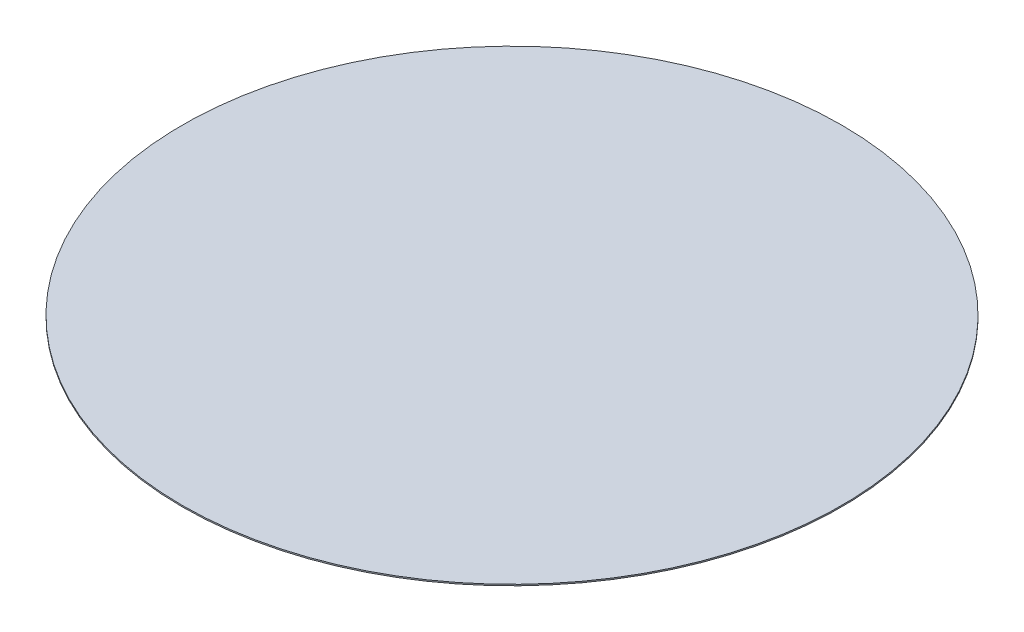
from build123d import *

# Parameters (mm, degrees)
SKETCH1_R           = 50
BOSS_EXTRUDE1_DEPTH = 0.2


with BuildPart() as part:
    # Sketch1 → Boss-Extrude1 (new body)
    with BuildSketch(Plane(origin=(0, 0, 0), x_dir=(1, 0, 0), z_dir=(0, 1, 0))):
        with Locations(Location((0, 0, 0), (0, 0, 270))):
            Circle(SKETCH1_R)
    extrude(amount=-BOSS_EXTRUDE1_DEPTH)


solid = part.part
